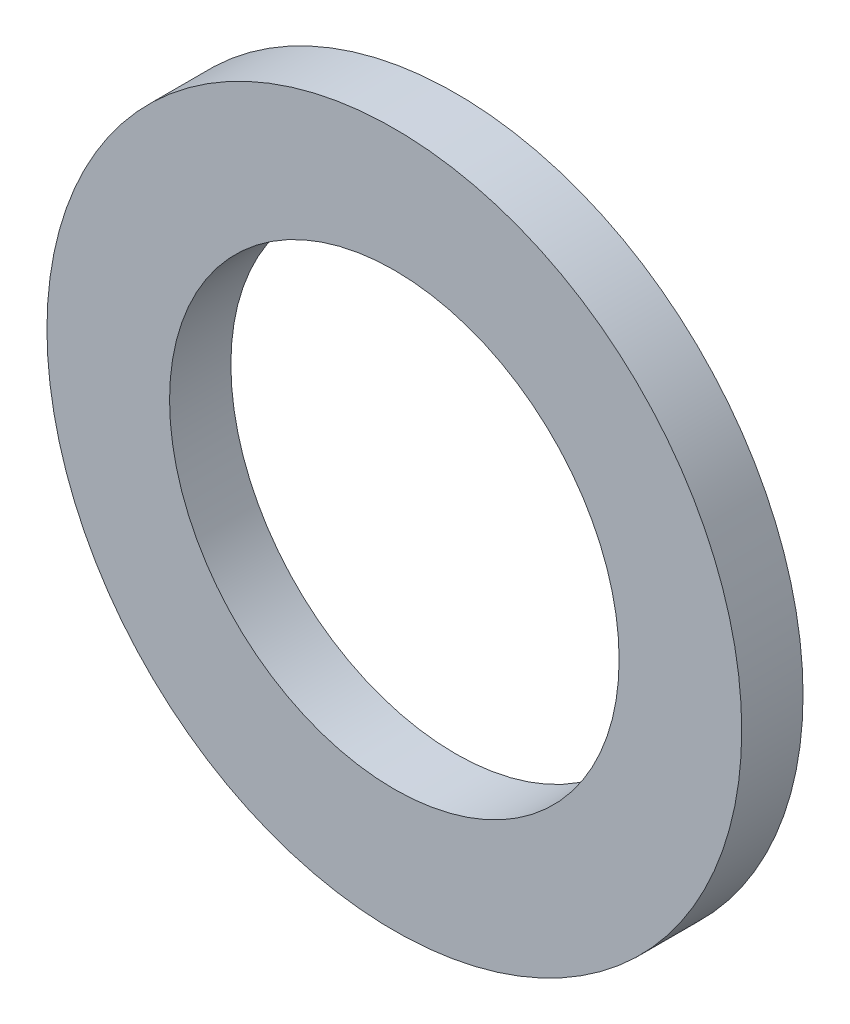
from build123d import *

# Parameters (mm, degrees)
ESQUISSE1_R      = 17
ESQUISSE1_R_2    = 11
EXTRUSION1_DEPTH = 3


with BuildPart() as part:
    # Esquisse1 → Extrusion1 (new body)
    with BuildSketch(Plane.XY):
        Circle(ESQUISSE1_R)
        Circle(ESQUISSE1_R_2, mode=Mode.SUBTRACT)
    extrude(amount=EXTRUSION1_DEPTH)


solid = part.part
